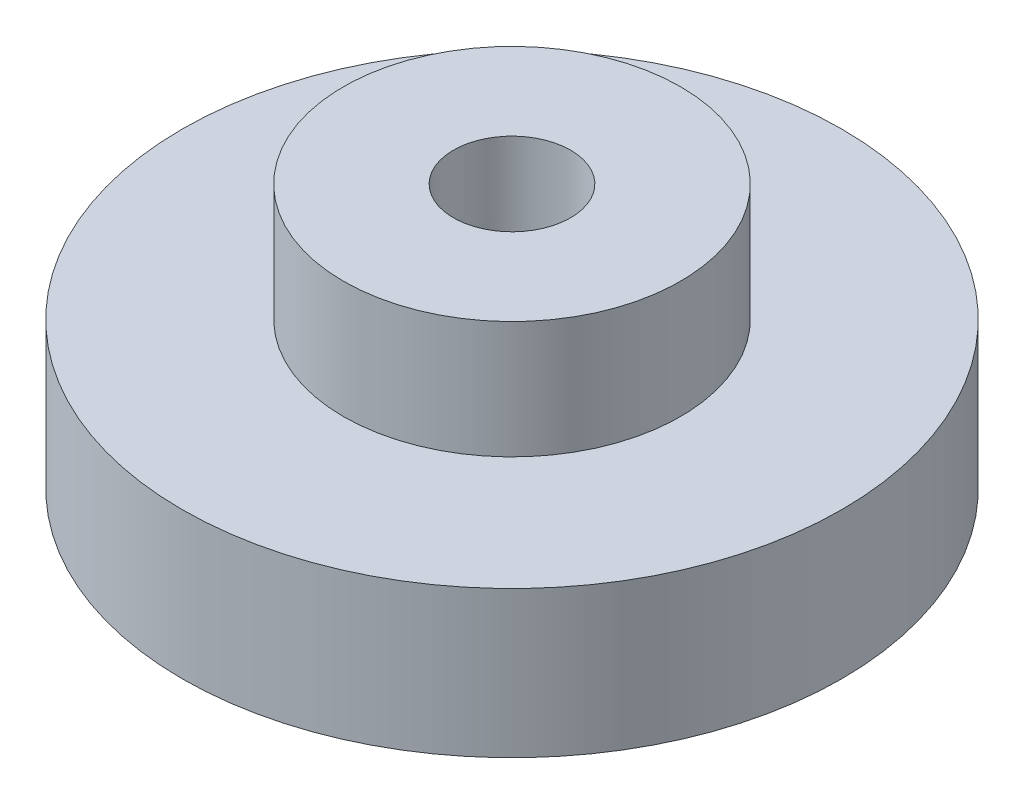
from build123d import *

# Parameters (mm, degrees)
SKETCH1_R               = 22.5
BOSS_EXTRUDE1_DEPTH     = 10
SKETCH2_R               = 11.5
BOSS_EXTRUDE2_DEPTH     = 8
CUT_EXTRUDE1_DEPTH      = 37.558172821
CUT_EXTRUDE1_DEPTH_BACK = 37.558172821
SKETCH3_R               = 4


with BuildPart() as part:
    # Sketch1 → Boss-Extrude1 (new body)
    with BuildSketch(Plane(origin=(0, 0, 0), x_dir=(1, 0, 0), z_dir=(0, 1, 0))):
        with Locations(Location((0, 0, 0), (0, 0, 270))):
            Circle(SKETCH1_R)
    extrude(amount=BOSS_EXTRUDE1_DEPTH)

    # Sketch2 → Boss-Extrude2 (add)
    with BuildSketch(Plane(origin=(0, 10, 0), x_dir=(1, 0, 0), z_dir=(0, 1, 0))):
        with Locations(Location((0, 0, 0), (0, 0, 270))):
            Circle(SKETCH2_R)
    extrude(amount=BOSS_EXTRUDE2_DEPTH)

    # Sketch3 → Cut-Extrude1 (cut, two sides: drawn at the far end of the back side and taken through both)
    with BuildSketch(Plane.XZ.offset(-CUT_EXTRUDE1_DEPTH_BACK)):
        with Locations(Location((0, 0, 0), (0, 0, 270))):
            Circle(SKETCH3_R)
    extrude(amount=CUT_EXTRUDE1_DEPTH + CUT_EXTRUDE1_DEPTH_BACK, mode=Mode.SUBTRACT)


solid = part.part
